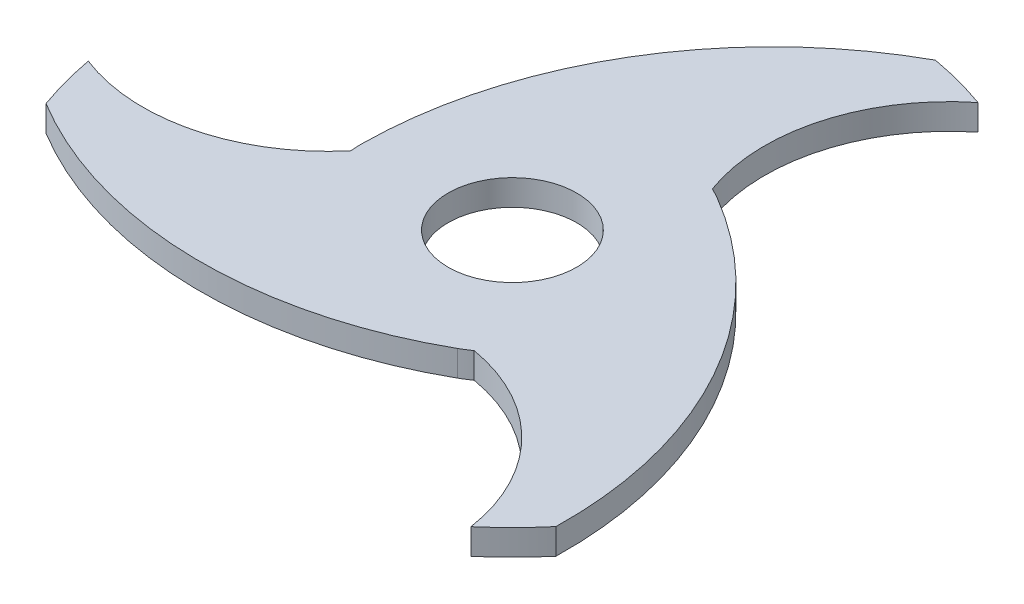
from build123d import *

# Parameters (mm, degrees)
SKETCH1_R           = 7.5
BOSS_EXTRUDE1_DEPTH = 3


with BuildPart() as part:
    # Sketch1 → Boss-Extrude1 (new body)
    with BuildSketch(Plane(origin=(0, 0, 0), x_dir=(1, 0, 0), z_dir=(0, 1, 0))):
        with BuildLine():
            ThreePointArc((7.5, 41.833001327), (-10.537793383, 24.523265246), (-17.492556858, 0.510347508))
            ThreePointArc((-17.492556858, 0.510347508), (-17.496953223, 0.255183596), (-17.5, 0))
            ThreePointArc((-17.5, 0), (-17.485760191, -0.705826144), (-17.443063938, -1.410503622))
            ThreePointArc((-17.443063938, -1.410503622), (-28.614792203, -8.465640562), (-41.80338007, -7.663381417))
            ThreePointArc((-41.80338007, -7.663381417), (-41.030281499, -11.079981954), (-39.978441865, -14.421310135))
            ThreePointArc((-39.978441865, -14.421310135), (-15.968873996, -21.387629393), (8.304304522, -15.40417237))
            ThreePointArc((8.304304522, -15.40417237), (8.527481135, -15.280397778), (8.75, -15.155444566))
            ThreePointArc((8.75, -15.155444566), (9.354143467, -14.790199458), (9.943063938, -14.400884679))
            ThreePointArc((9.943063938, -14.400884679), (21.638855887, -20.548316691), (27.538373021, -32.371098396))
            ThreePointArc((27.538373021, -32.371098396), (30.110686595, -29.993275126), (32.478441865, -27.411691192))
            ThreePointArc((32.478441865, -27.411691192), (26.506667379, -3.135635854), (9.188252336, 14.893824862))
            ThreePointArc((9.188252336, 14.893824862), (8.969472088, 15.025214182), (8.75, 15.155444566))
            ThreePointArc((8.75, 15.155444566), (8.131616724, 15.496025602), (7.5, 15.811388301))
            ThreePointArc((7.5, 15.811388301), (6.975936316, 29.013957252), (14.265007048, 40.034479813))
            ThreePointArc((14.265007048, 40.034479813), (10.919594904, 41.07325708), (7.5, 41.833001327))
        make_face()
        with Locations(Location((0, 0, 0), (0, 0, 270))):
            Circle(SKETCH1_R, mode=Mode.SUBTRACT)
    extrude(amount=BOSS_EXTRUDE1_DEPTH)


solid = part.part
